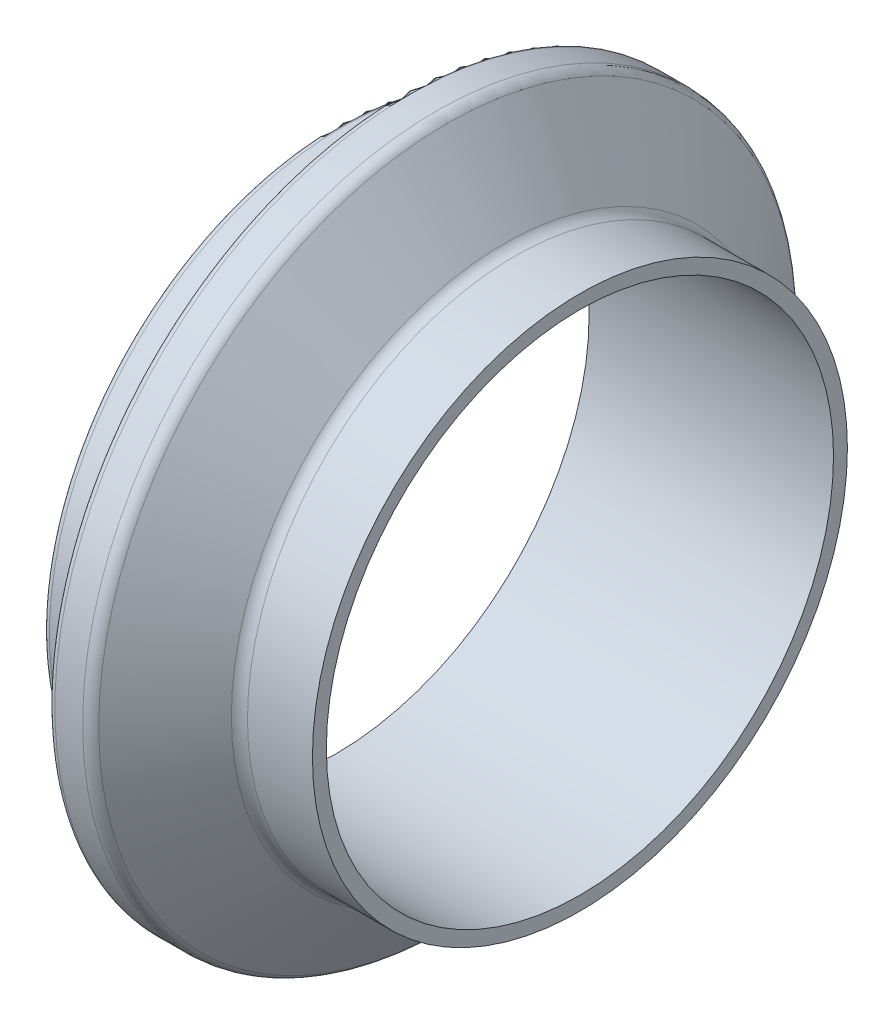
from build123d import *


with BuildPart() as part:
    # Sketch1 → Revolve1 (revolve)
    with BuildSketch(Plane.XY, mode=Mode.PRIVATE) as revolve1_sk:
        with BuildLine():
            Line((0, 30.099), (-29.0068, 30.099))
            Line((-29.0068, 30.099), (-29.0068, 33.9598))
            ThreePointArc((-29.0068, 33.9598), (-28.768736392, 34.534536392), (-28.194, 34.7726))
            Line((-28.194, 34.7726), (-21.9456, 34.7726))
            ThreePointArc((-21.9456, 34.7726), (-21.370863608, 35.010663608), (-21.1328, 35.5854))
            Line((-21.1328, 35.5854), (-21.1328, 41.1861))
            ThreePointArc((-21.1328, 41.1861), (-20.894736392, 41.760836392), (-20.32, 41.9989))
            Line((-20.32, 41.9989), (-17.028430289, 41.9989))
            ThreePointArc((-17.028430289, 41.9989), (-16.314424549, 41.830773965), (-15.750453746, 41.3617244))
            Line((-15.750453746, 41.3617244), (-8.98764615, 32.3871756))
            ThreePointArc((-8.98764615, 32.3871756), (-8.423675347, 31.918126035), (-7.709669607, 31.75))
            Line((-7.709669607, 31.75), (0, 31.75))
            Line((0, 31.75), (0, 30.099))
        make_face()
    revolve(revolve1_sk.sketch.rotate(Axis((0, 0, 0), (-1, 0, 0)), 90), axis=Axis((0, 0, 0), (-1, 0, 0)))


solid = part.part
